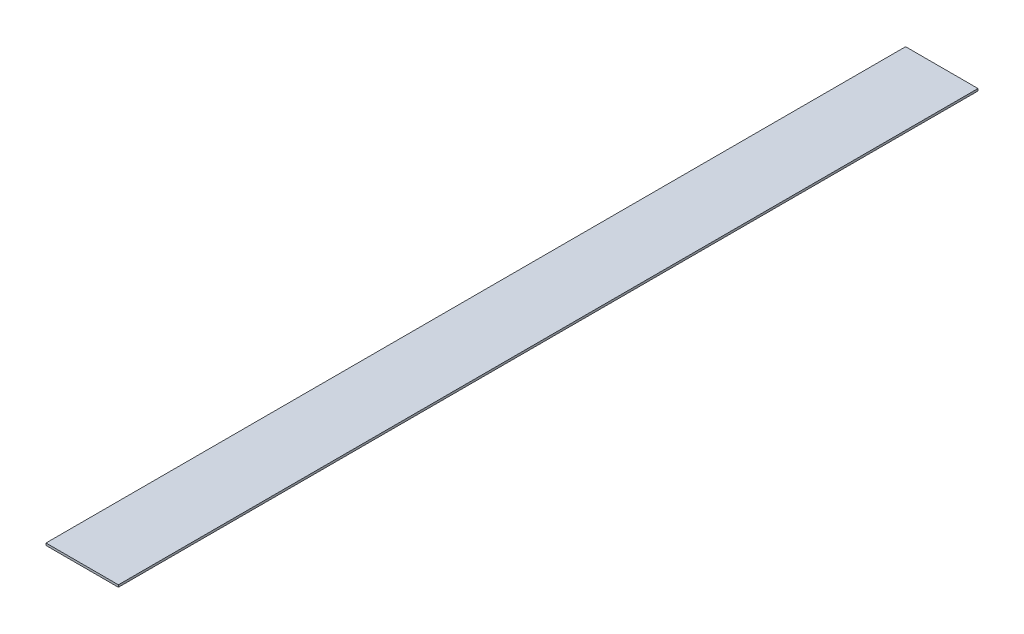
ISO-10303-21;
HEADER;
FILE_DESCRIPTION(('STEP AP214'),'2;1');
FILE_NAME('part.step','',(''),(''),'','','');
FILE_SCHEMA(('AUTOMOTIVE_DESIGN { 1 0 10303 214 1 1 1 1 }'));
ENDSEC;
DATA;
#1=APPLICATION_CONTEXT('core data for automotive mechanical design processes');
#2=APPLICATION_PROTOCOL_DEFINITION('international standard','automotive_design',2000,#1);
#3=PRODUCT_CONTEXT('',#1,'mechanical');
#4=PRODUCT('Part','Part','',(#3));
#5=PRODUCT_RELATED_PRODUCT_CATEGORY('part','',(#4));
#6=PRODUCT_DEFINITION_FORMATION('','',#4);
#7=PRODUCT_DEFINITION_CONTEXT('part definition',#1,'design');
#8=PRODUCT_DEFINITION('design','',#6,#7);
#9=PRODUCT_DEFINITION_SHAPE('','',#8);
#10=(LENGTH_UNIT() NAMED_UNIT(*) SI_UNIT(.MILLI.,.METRE.));
#11=(NAMED_UNIT(*) PLANE_ANGLE_UNIT() SI_UNIT($,.RADIAN.));
#12=(NAMED_UNIT(*) SI_UNIT($,.STERADIAN.) SOLID_ANGLE_UNIT());
#13=UNCERTAINTY_MEASURE_WITH_UNIT(LENGTH_MEASURE(1.E-05),#10,'distance_accuracy_value','');
#14=(GEOMETRIC_REPRESENTATION_CONTEXT(3) GLOBAL_UNCERTAINTY_ASSIGNED_CONTEXT((#13)) GLOBAL_UNIT_ASSIGNED_CONTEXT((#10,
#11,#12)) REPRESENTATION_CONTEXT('',''));
#15=CARTESIAN_POINT('',(0.,0.,0.));
#16=DIRECTION('',(0.,0.,1.));
#17=DIRECTION('',(1.,0.,0.));
#18=AXIS2_PLACEMENT_3D('',#15,#16,#17);
#19=CARTESIAN_POINT('',(-2.3913464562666,1087.87,0.));
#20=DIRECTION('',(0.,0.,1.));
#21=DIRECTION('',(0.,1.,0.));
#22=AXIS2_PLACEMENT_3D('',#19,#20,#21);
#23=PLANE('',#22);
#24=DIRECTION('',(-1.,0.,0.));
#25=VECTOR('',#24,1.);
#26=CARTESIAN_POINT('',(0.608653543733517,1082.5,0.));
#27=LINE('',#26,#25);
#28=CARTESIAN_POINT('',(35.,1082.5,0.));
#29=VERTEX_POINT('',#28);
#30=CARTESIAN_POINT('',(-64.3913464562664,1082.5,0.));
#31=VERTEX_POINT('',#30);
#32=EDGE_CURVE('E111',#29,#31,#27,.T.);
#33=ORIENTED_EDGE('',*,*,#32,.F.);
#34=DIRECTION('',(0.,-1.,0.));
#35=VECTOR('',#34,1.);
#36=CARTESIAN_POINT('',(34.9999999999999,1085.5,0.));
#37=LINE('',#36,#35);
#38=CARTESIAN_POINT('',(34.9999999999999,1085.5,0.));
#39=VERTEX_POINT('',#38);
#40=EDGE_CURVE('E101',#39,#29,#37,.T.);
#41=ORIENTED_EDGE('',*,*,#40,.F.);
#42=DIRECTION('',(-1.,0.,0.));
#43=VECTOR('',#42,1.);
#44=CARTESIAN_POINT('',(0.608653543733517,1085.5,0.));
#45=LINE('',#44,#43);
#46=CARTESIAN_POINT('',(-64.3913464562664,1085.5,0.));
#47=VERTEX_POINT('',#46);
#48=EDGE_CURVE('E100',#39,#47,#45,.T.);
#49=ORIENTED_EDGE('',*,*,#48,.T.);
#50=DIRECTION('',(0.,1.,0.));
#51=VECTOR('',#50,1.);
#52=CARTESIAN_POINT('',(-64.3913464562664,1082.5,0.));
#53=LINE('',#52,#51);
#54=EDGE_CURVE('E109',#31,#47,#53,.T.);
#55=ORIENTED_EDGE('',*,*,#54,.F.);
#56=EDGE_LOOP('',(#33,#41,#49,#55));
#57=FACE_BOUND('',#56,.T.);
#58=ADVANCED_FACE('F41',(#57),#23,.T.);
#59=CARTESIAN_POINT('',(0.608653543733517,1085.5,-1256.32168761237));
#60=DIRECTION('',(0.,1.,0.));
#61=DIRECTION('',(0.,0.,-1.));
#62=AXIS2_PLACEMENT_3D('',#59,#60,#61);
#63=PLANE('',#62);
#64=ORIENTED_EDGE('',*,*,#48,.F.);
#65=DIRECTION('',(0.,0.,1.));
#66=VECTOR('',#65,1.);
#67=CARTESIAN_POINT('',(34.9999999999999,1085.5,-1256.32168761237));
#68=LINE('',#67,#66);
#69=CARTESIAN_POINT('',(34.9999999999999,1085.5,-1180.));
#70=VERTEX_POINT('',#69);
#71=EDGE_CURVE('E94',#70,#39,#68,.T.);
#72=ORIENTED_EDGE('',*,*,#71,.F.);
#73=DIRECTION('',(1.,0.,0.));
#74=VECTOR('',#73,1.);
#75=CARTESIAN_POINT('',(0.608653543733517,1085.5,-1180.));
#76=LINE('',#75,#74);
#77=CARTESIAN_POINT('',(-64.3913464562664,1085.5,-1180.));
#78=VERTEX_POINT('',#77);
#79=EDGE_CURVE('E79',#78,#70,#76,.T.);
#80=ORIENTED_EDGE('',*,*,#79,.F.);
#81=DIRECTION('',(0.,0.,1.));
#82=VECTOR('',#81,1.);
#83=CARTESIAN_POINT('',(-64.3913464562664,1085.5,-1256.32168761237));
#84=LINE('',#83,#82);
#85=EDGE_CURVE('E45',#78,#47,#84,.T.);
#86=ORIENTED_EDGE('',*,*,#85,.T.);
#87=EDGE_LOOP('',(#64,#72,#80,#86));
#88=FACE_BOUND('',#87,.T.);
#89=ADVANCED_FACE('F98',(#88),#63,.T.);
#90=CARTESIAN_POINT('',(35.,1082.5,-1256.32168761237));
#91=DIRECTION('',(0.,1.,0.));
#92=DIRECTION('',(-1.,0.,0.));
#93=AXIS2_PLACEMENT_3D('',#90,#91,#92);
#94=PLANE('',#93);
#95=DIRECTION('',(-1.,0.,0.));
#96=VECTOR('',#95,1.);
#97=CARTESIAN_POINT('',(0.608653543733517,1082.5,-1180.));
#98=LINE('',#97,#96);
#99=CARTESIAN_POINT('',(-64.3913464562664,1082.5,-1180.));
#100=VERTEX_POINT('',#99);
#101=CARTESIAN_POINT('',(35.,1082.5,-1180.));
#102=VERTEX_POINT('',#101);
#103=EDGE_CURVE('E56',#100,#102,#98,.F.);
#104=ORIENTED_EDGE('',*,*,#103,.T.);
#105=DIRECTION('',(0.,0.,1.));
#106=VECTOR('',#105,1.);
#107=CARTESIAN_POINT('',(35.,1082.5,-1256.32168761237));
#108=LINE('',#107,#106);
#109=EDGE_CURVE('E88',#102,#29,#108,.T.);
#110=ORIENTED_EDGE('',*,*,#109,.T.);
#111=ORIENTED_EDGE('',*,*,#32,.T.);
#112=DIRECTION('',(0.,0.,1.));
#113=VECTOR('',#112,1.);
#114=CARTESIAN_POINT('',(-64.3913464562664,1082.5,-1256.32168761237));
#115=LINE('',#114,#113);
#116=EDGE_CURVE('E12',#100,#31,#115,.T.);
#117=ORIENTED_EDGE('',*,*,#116,.F.);
#118=EDGE_LOOP('',(#104,#110,#111,#117));
#119=FACE_BOUND('',#118,.T.);
#120=ADVANCED_FACE('F43',(#119),#94,.F.);
#121=CARTESIAN_POINT('',(-64.3913464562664,1082.5,-1256.32168761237));
#122=DIRECTION('',(1.,0.,0.));
#123=DIRECTION('',(0.,0.,-1.));
#124=AXIS2_PLACEMENT_3D('',#121,#122,#123);
#125=PLANE('',#124);
#126=DIRECTION('',(0.,1.,0.));
#127=VECTOR('',#126,1.);
#128=CARTESIAN_POINT('',(-64.3913464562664,1085.5,-1180.));
#129=LINE('',#128,#127);
#130=EDGE_CURVE('E84',#78,#100,#129,.F.);
#131=ORIENTED_EDGE('',*,*,#130,.T.);
#132=ORIENTED_EDGE('',*,*,#116,.T.);
#133=ORIENTED_EDGE('',*,*,#54,.T.);
#134=ORIENTED_EDGE('',*,*,#85,.F.);
#135=EDGE_LOOP('',(#131,#132,#133,#134));
#136=FACE_BOUND('',#135,.T.);
#137=ADVANCED_FACE('F114',(#136),#125,.F.);
#138=CARTESIAN_POINT('',(0.608653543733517,1085.5,-1180.));
#139=DIRECTION('',(0.,0.,1.));
#140=DIRECTION('',(1.,0.,0.));
#141=AXIS2_PLACEMENT_3D('',#138,#139,#140);
#142=PLANE('',#141);
#143=ORIENTED_EDGE('',*,*,#79,.T.);
#144=DIRECTION('',(0.,-1.,0.));
#145=VECTOR('',#144,1.);
#146=CARTESIAN_POINT('',(35.,1082.5,-1180.));
#147=LINE('',#146,#145);
#148=EDGE_CURVE('E82',#102,#70,#147,.F.);
#149=ORIENTED_EDGE('',*,*,#148,.F.);
#150=ORIENTED_EDGE('',*,*,#103,.F.);
#151=ORIENTED_EDGE('',*,*,#130,.F.);
#152=EDGE_LOOP('',(#143,#149,#150,#151));
#153=FACE_BOUND('',#152,.T.);
#154=ADVANCED_FACE('F81',(#153),#142,.F.);
#155=CARTESIAN_POINT('',(34.9999999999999,1085.5,-1256.32168761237));
#156=DIRECTION('',(-1.,0.,0.));
#157=DIRECTION('',(0.,-1.,0.));
#158=AXIS2_PLACEMENT_3D('',#155,#156,#157);
#159=PLANE('',#158);
#160=ORIENTED_EDGE('',*,*,#148,.T.);
#161=ORIENTED_EDGE('',*,*,#71,.T.);
#162=ORIENTED_EDGE('',*,*,#40,.T.);
#163=ORIENTED_EDGE('',*,*,#109,.F.);
#164=EDGE_LOOP('',(#160,#161,#162,#163));
#165=FACE_BOUND('',#164,.T.);
#166=ADVANCED_FACE('F92',(#165),#159,.F.);
#167=CLOSED_SHELL('',(#58,#89,#120,#137,#154,#166));
#168=MANIFOLD_SOLID_BREP('B2',#167);
#169=ADVANCED_BREP_SHAPE_REPRESENTATION('',(#18,#168),#14);
#170=SHAPE_DEFINITION_REPRESENTATION(#9,#169);
ENDSEC;
END-ISO-10303-21;
